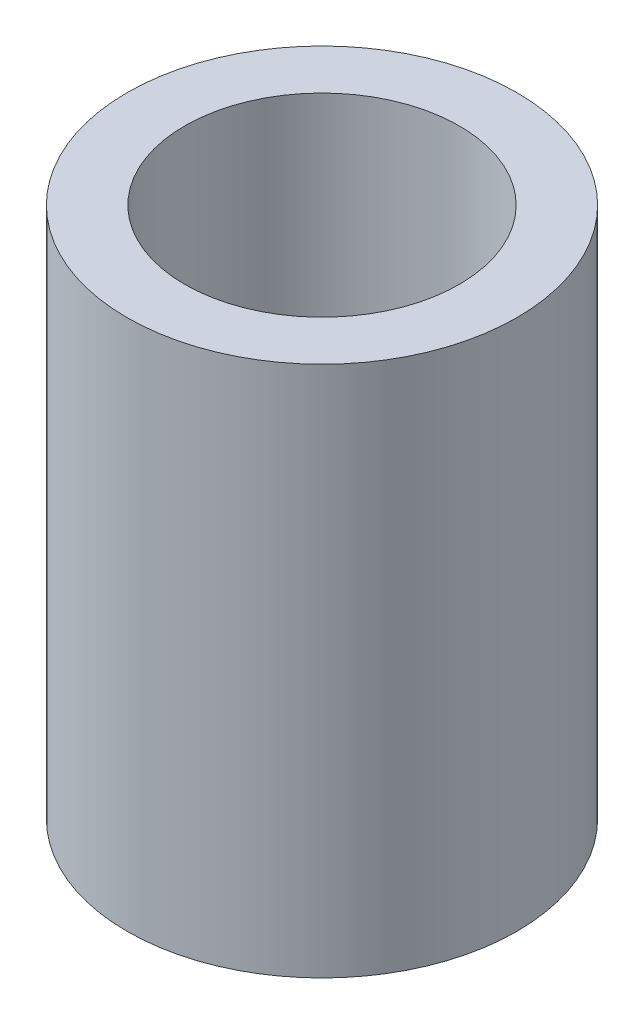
from build123d import *

# Parameters (mm, degrees)
ESQUISSE1_R      = 11
ESQUISSE1_R_2    = 7.75
EXTRUSION1_DEPTH = 30


with BuildPart() as part:
    # Esquisse1 → Extrusion1 (new body)
    with BuildSketch(Plane(origin=(0, 0, 0), x_dir=(1, 0, 0), z_dir=(0, 1, 0))):
        with Locations(Location((0, 0, 0), (0, 0, 270))):
            Circle(ESQUISSE1_R)
        with Locations(Location((0, 0, 0), (0, 0, 270))):
            Circle(ESQUISSE1_R_2, mode=Mode.SUBTRACT)
    extrude(amount=EXTRUSION1_DEPTH)


solid = part.part
